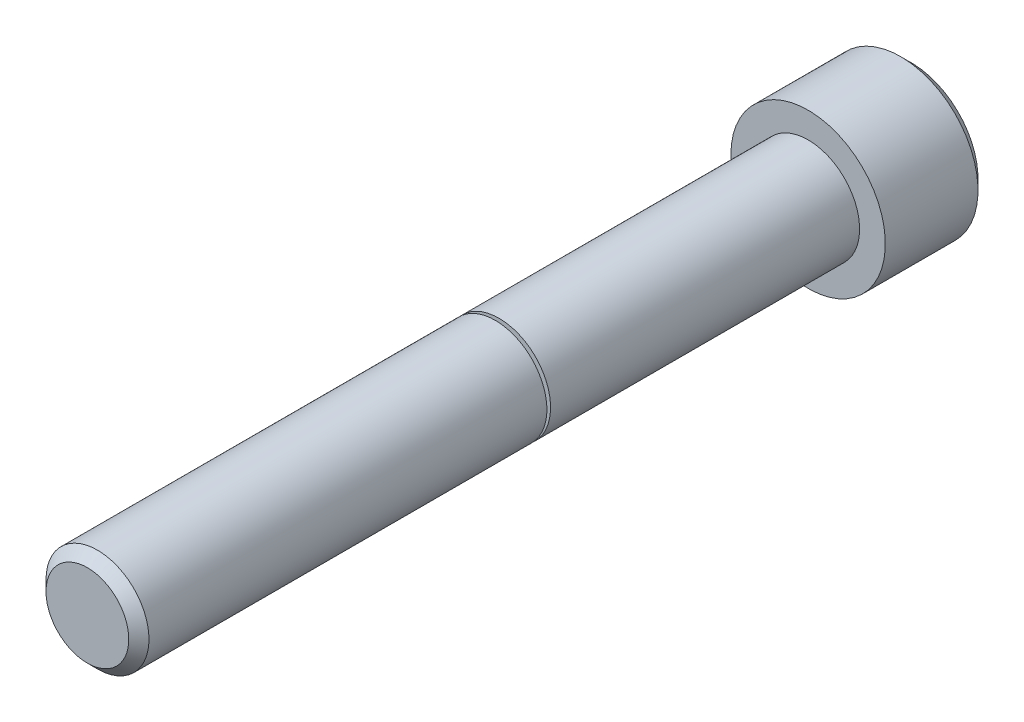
from build123d import *

# Parameters (mm, degrees)
CUT_EXTRUDE1_DEPTH = 3.175


with BuildPart() as part:
    # Logo3_bib1 → Revolve1 (revolve)
    with BuildSketch(Plane(origin=(0, 0, 0), x_dir=(-1, 0, 0), z_dir=(0, -1, 0))):
        with BuildLine():
            Line((0, -44.45), (0, 6.35))
            Line((0, 6.35), (4.1275, 6.35))
            Line((4.1275, 6.35), (4.7625, 5.715))
            Line((4.7625, 5.715), (4.7625, 0))
            Line((4.7625, 0), (3.175, 0))
            Line((3.175, 0), (3.175, -19.06))
            Line((3.175, -19.06), (2.666125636, -19.06))
            ThreePointArc((2.666125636, -19.06), (2.646429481, -19.076527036), (2.659285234, -19.098793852))
            Line((2.659285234, -19.098793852), (3.175, -19.286498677))
            Line((3.175, -19.286498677), (3.175, -43.8277))
            Line((3.175, -43.8277), (2.5527, -44.45))
            Line((2.5527, -44.45), (0, -44.45))
        make_face()
    revolve(axis=Axis((0, 0, -10.585154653), (0, 0, 1)))

    # Logo3_bib2 → Cut-Extrude1 (cut)
    with BuildSketch(Plane(origin=(0, 0, -6.35), x_dir=(1, 0, 0), z_dir=(0, 0, -1))):
        Polygon((2.749630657, 0), (1.374815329, 2.38125), (-1.374815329, 2.38125), (-2.749630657, 0), (-1.374815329, -2.38125), (1.374815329, -2.38125), align=None)
    extrude(amount=-CUT_EXTRUDE1_DEPTH, mode=Mode.SUBTRACT)


solid = part.part
